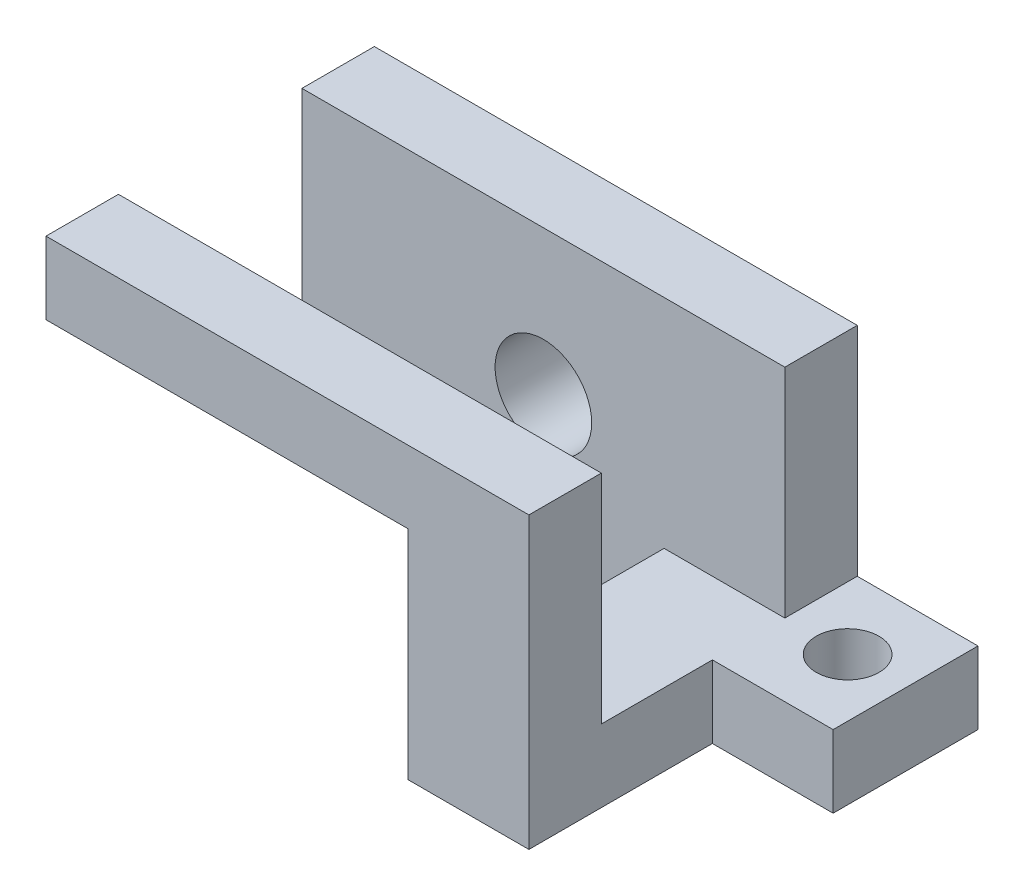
from build123d import *

# Parameters (mm, degrees)
SKETCH1_W           = 100
SKETCH1_H           = 60
SKETCH1_R           = 10
BOSS_EXTRUDE1_DEPTH = 15
SKETCH2_W           = 25
SKETCH2_H           = 15
BOSS_EXTRUDE2_DEPTH = 53
SKETCH3_W           = 25
SKETCH3_H           = 15
BOSS_EXTRUDE3_DEPTH = 45
SKETCH4_W           = 15
SKETCH4_H           = 15
BOSS_EXTRUDE4_DEPTH = 75
SKETCH5_W           = 30
SKETCH5_H           = 15
BOSS_EXTRUDE6_DEPTH = 25
SKETCH7_R           = 6.5
CUT_EXTRUDE2_DEPTH  = 103.269252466


with BuildPart() as part:
    # Sketch1 → Boss-Extrude1 (new body)
    with BuildSketch(Plane.XY):
        Rectangle(SKETCH1_W, SKETCH1_H)
        Circle(SKETCH1_R, mode=Mode.SUBTRACT)
    extrude(amount=-BOSS_EXTRUDE1_DEPTH)

    # Sketch2 → Boss-Extrude2 (add)
    with BuildSketch(Plane.XY):
        with Locations((37.5, -22.5)):
            Rectangle(SKETCH2_W, SKETCH2_H)
    extrude(amount=BOSS_EXTRUDE2_DEPTH)

    # Sketch3 → Boss-Extrude3 (add)
    with BuildSketch(Plane(origin=(0, -15, 0), x_dir=(1, 0, 0), z_dir=(0, 1, 0))):
        with Locations((37.5, -45.5)):
            Rectangle(SKETCH3_W, SKETCH3_H)
    extrude(amount=BOSS_EXTRUDE3_DEPTH)

    # Sketch4 → Boss-Extrude4 (add)
    with BuildSketch(Plane.ZY.offset(-25)):
        with Locations((45.5, 22.5)):
            Rectangle(SKETCH4_W, SKETCH4_H)
    extrude(amount=BOSS_EXTRUDE4_DEPTH)

    # Sketch5 → Boss-Extrude6 (add)
    with BuildSketch(Plane(origin=(50, 0, 0), x_dir=(0, 0, -1), z_dir=(1, 0, 0))):
        with Locations((0, -22.5)):
            Rectangle(SKETCH5_W, SKETCH5_H)
    extrude(amount=BOSS_EXTRUDE6_DEPTH)

    # Sketch7 → Cut-Extrude2 (cut, through all)
    with BuildSketch(Plane(origin=(0, -15, 0), x_dir=(1, 0, 0), z_dir=(0, 1, 0))):
        with Locations(Location((63, 0, 0), (0, 0, 180))):
            Circle(SKETCH7_R)
    extrude(amount=-CUT_EXTRUDE2_DEPTH, mode=Mode.SUBTRACT)


solid = part.part
